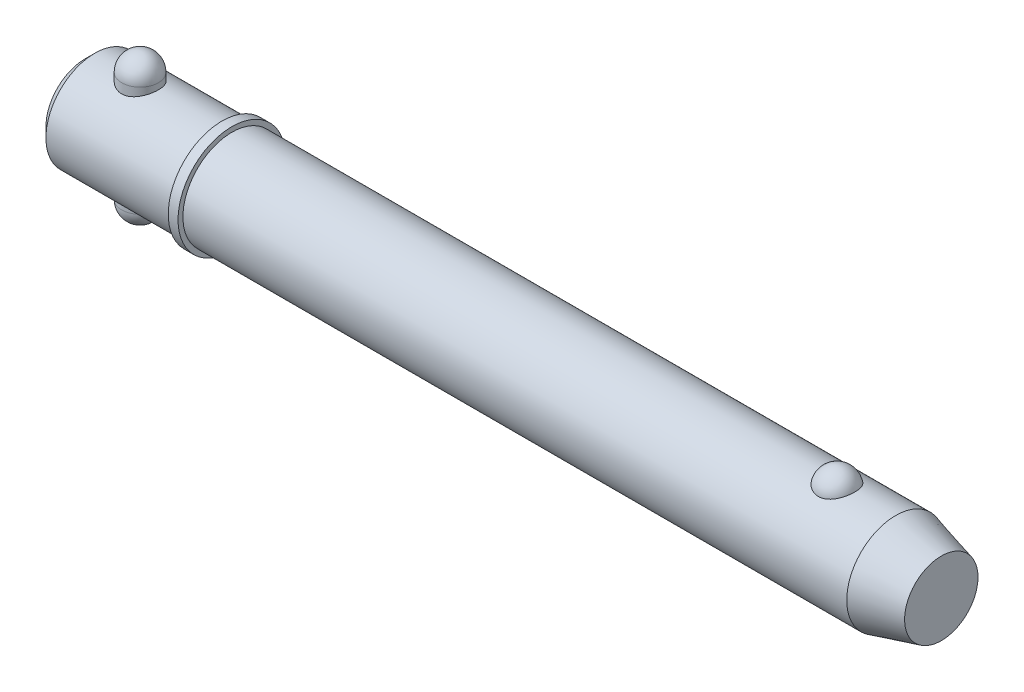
ISO-10303-21;
HEADER;
FILE_DESCRIPTION(('STEP AP214'),'2;1');
FILE_NAME('part.step','',(''),(''),'','','');
FILE_SCHEMA(('AUTOMOTIVE_DESIGN { 1 0 10303 214 1 1 1 1 }'));
ENDSEC;
DATA;
#1=APPLICATION_CONTEXT('core data for automotive mechanical design processes');
#2=APPLICATION_PROTOCOL_DEFINITION('international standard','automotive_design',2000,#1);
#3=PRODUCT_CONTEXT('',#1,'mechanical');
#4=PRODUCT('Part','Part','',(#3));
#5=PRODUCT_RELATED_PRODUCT_CATEGORY('part','',(#4));
#6=PRODUCT_DEFINITION_FORMATION('','',#4);
#7=PRODUCT_DEFINITION_CONTEXT('part definition',#1,'design');
#8=PRODUCT_DEFINITION('design','',#6,#7);
#9=PRODUCT_DEFINITION_SHAPE('','',#8);
#10=(LENGTH_UNIT() NAMED_UNIT(*) SI_UNIT(.MILLI.,.METRE.));
#11=(NAMED_UNIT(*) PLANE_ANGLE_UNIT() SI_UNIT($,.RADIAN.));
#12=(NAMED_UNIT(*) SI_UNIT($,.STERADIAN.) SOLID_ANGLE_UNIT());
#13=UNCERTAINTY_MEASURE_WITH_UNIT(LENGTH_MEASURE(1.E-05),#10,'distance_accuracy_value','');
#14=(GEOMETRIC_REPRESENTATION_CONTEXT(3) GLOBAL_UNCERTAINTY_ASSIGNED_CONTEXT((#13)) GLOBAL_UNIT_ASSIGNED_CONTEXT((#10,
#11,#12)) REPRESENTATION_CONTEXT('',''));
#15=CARTESIAN_POINT('',(0.,0.,0.));
#16=DIRECTION('',(0.,0.,1.));
#17=DIRECTION('',(1.,0.,0.));
#18=AXIS2_PLACEMENT_3D('',#15,#16,#17);
#19=CARTESIAN_POINT('',(14.28,19.05,0.));
#20=DIRECTION('',(0.,-1.,0.));
#21=DIRECTION('',(0.,0.,-1.));
#22=AXIS2_PLACEMENT_3D('',#19,#20,#21);
#23=CYLINDRICAL_SURFACE('',#22,4.76);
#24=CARTESIAN_POINT('',(14.28,-14.29,0.));
#25=DIRECTION('',(0.,-1.,0.));
#26=DIRECTION('',(0.,0.,-1.));
#27=AXIS2_PLACEMENT_3D('',#24,#25,#26);
#28=CIRCLE('',#27,4.76);
#29=CARTESIAN_POINT('',(14.28,-14.29,-4.76));
#30=VERTEX_POINT('',#29);
#31=EDGE_CURVE('P0_E10',#30,#30,#28,.F.);
#32=CARTESIAN_POINT('',(14.28,14.29,0.));
#33=DIRECTION('',(0.,-1.,0.));
#34=DIRECTION('',(0.,0.,-1.));
#35=AXIS2_PLACEMENT_3D('',#32,#33,#34);
#36=CIRCLE('',#35,4.76);
#37=CARTESIAN_POINT('',(14.28,14.29,-4.76));
#38=VERTEX_POINT('',#37);
#39=EDGE_CURVE('P0_E21',#38,#38,#36,.T.);
#40=CARTESIAN_POINT('',(14.28,-14.29,-4.76));
#41=CARTESIAN_POINT('',(14.28,-13.9922916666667,-4.76));
#42=CARTESIAN_POINT('',(14.28,-13.6945833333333,-4.76));
#43=CARTESIAN_POINT('',(14.28,-13.0991666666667,-4.76));
#44=CARTESIAN_POINT('',(14.28,-12.8014583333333,-4.76));
#45=CARTESIAN_POINT('',(14.28,-12.2060416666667,-4.76));
#46=CARTESIAN_POINT('',(14.28,-11.9083333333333,-4.76));
#47=CARTESIAN_POINT('',(14.28,-11.3129166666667,-4.76));
#48=CARTESIAN_POINT('',(14.28,-11.0152083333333,-4.76));
#49=CARTESIAN_POINT('',(14.28,-10.4197916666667,-4.76));
#50=CARTESIAN_POINT('',(14.28,-10.1220833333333,-4.76));
#51=CARTESIAN_POINT('',(14.28,-9.52666666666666,-4.76));
#52=CARTESIAN_POINT('',(14.28,-9.22895833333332,-4.76));
#53=CARTESIAN_POINT('',(14.28,-8.63354166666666,-4.76));
#54=CARTESIAN_POINT('',(14.28,-8.33583333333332,-4.76));
#55=CARTESIAN_POINT('',(14.28,-7.74041666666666,-4.76));
#56=CARTESIAN_POINT('',(14.28,-7.44270833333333,-4.76));
#57=CARTESIAN_POINT('',(14.28,-6.84729166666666,-4.76));
#58=CARTESIAN_POINT('',(14.28,-6.54958333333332,-4.76));
#59=CARTESIAN_POINT('',(14.28,-5.95416666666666,-4.76));
#60=CARTESIAN_POINT('',(14.28,-5.65645833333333,-4.76));
#61=CARTESIAN_POINT('',(14.28,-5.06104166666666,-4.76));
#62=CARTESIAN_POINT('',(14.28,-4.76333333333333,-4.76));
#63=CARTESIAN_POINT('',(14.28,-4.16791666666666,-4.76));
#64=CARTESIAN_POINT('',(14.28,-3.87020833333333,-4.76));
#65=CARTESIAN_POINT('',(14.28,-3.27479166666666,-4.76));
#66=CARTESIAN_POINT('',(14.28,-2.97708333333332,-4.76));
#67=CARTESIAN_POINT('',(14.28,-2.38166666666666,-4.76));
#68=CARTESIAN_POINT('',(14.28,-2.08395833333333,-4.76));
#69=CARTESIAN_POINT('',(14.28,-1.48854166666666,-4.76));
#70=CARTESIAN_POINT('',(14.28,-1.19083333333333,-4.76));
#71=CARTESIAN_POINT('',(14.28,-0.595416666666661,-4.76));
#72=CARTESIAN_POINT('',(14.28,-0.297708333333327,-4.76));
#73=CARTESIAN_POINT('',(14.28,0.297708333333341,-4.76));
#74=CARTESIAN_POINT('',(14.28,0.595416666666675,-4.76));
#75=CARTESIAN_POINT('',(14.28,1.19083333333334,-4.76));
#76=CARTESIAN_POINT('',(14.28,1.48854166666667,-4.76));
#77=CARTESIAN_POINT('',(14.28,2.08395833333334,-4.76));
#78=CARTESIAN_POINT('',(14.28,2.38166666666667,-4.76));
#79=CARTESIAN_POINT('',(14.28,2.97708333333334,-4.76));
#80=CARTESIAN_POINT('',(14.28,3.27479166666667,-4.76));
#81=CARTESIAN_POINT('',(14.28,3.87020833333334,-4.76));
#82=CARTESIAN_POINT('',(14.28,4.16791666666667,-4.76));
#83=CARTESIAN_POINT('',(14.28,4.76333333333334,-4.76));
#84=CARTESIAN_POINT('',(14.28,5.06104166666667,-4.76));
#85=CARTESIAN_POINT('',(14.28,5.65645833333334,-4.76));
#86=CARTESIAN_POINT('',(14.28,5.95416666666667,-4.76));
#87=CARTESIAN_POINT('',(14.28,6.54958333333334,-4.76));
#88=CARTESIAN_POINT('',(14.28,6.84729166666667,-4.76));
#89=CARTESIAN_POINT('',(14.28,7.44270833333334,-4.76));
#90=CARTESIAN_POINT('',(14.28,7.74041666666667,-4.76));
#91=CARTESIAN_POINT('',(14.28,8.33583333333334,-4.76));
#92=CARTESIAN_POINT('',(14.28,8.63354166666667,-4.76));
#93=CARTESIAN_POINT('',(14.28,9.22895833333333,-4.76));
#94=CARTESIAN_POINT('',(14.28,9.52666666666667,-4.76));
#95=CARTESIAN_POINT('',(14.28,10.1220833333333,-4.76));
#96=CARTESIAN_POINT('',(14.28,10.4197916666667,-4.76));
#97=CARTESIAN_POINT('',(14.28,11.0152083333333,-4.76));
#98=CARTESIAN_POINT('',(14.28,11.3129166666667,-4.76));
#99=CARTESIAN_POINT('',(14.28,11.9083333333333,-4.76));
#100=CARTESIAN_POINT('',(14.28,12.2060416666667,-4.76));
#101=CARTESIAN_POINT('',(14.28,12.8014583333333,-4.76));
#102=CARTESIAN_POINT('',(14.28,13.0991666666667,-4.76));
#103=CARTESIAN_POINT('',(14.28,13.6945833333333,-4.76));
#104=CARTESIAN_POINT('',(14.28,13.9922916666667,-4.76));
#105=CARTESIAN_POINT('',(14.28,14.29,-4.76));
#106=B_SPLINE_CURVE_WITH_KNOTS('',3,(#40,#41,#42,#43,#44,#45,#46,#47,#48,#49,#50,#51,#52,#53,
#54,#55,#56,#57,#58,#59,#60,#61,#62,#63,#64,#65,#66,#67,#68,#69,#70,#71,#72,#73,#74,#75,#76,#77,
#78,#79,#80,#81,#82,#83,#84,#85,#86,#87,#88,#89,#90,#91,#92,#93,#94,#95,#96,#97,#98,#99,#100,
#101,#102,#103,#104,#105),.UNSPECIFIED.,.F.,.F.,(4,2,2,2,2,2,2,2,2,2,2,2,2,2,2,2,2,2,2,2,2,2,2,
2,2,2,2,2,2,2,2,2,4),(0.,0.893125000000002,1.78625,2.67937499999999,3.5725,4.465625,5.35875,
6.25187499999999,7.145,8.038125,8.93125,9.82437499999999,10.7175,11.610625,12.50375,13.396875,
14.29,15.183125,16.07625,16.969375,17.8625,18.755625,19.64875,20.541875,21.435,22.328125,
23.22125,24.114375,25.0075,25.900625,26.79375,27.686875,28.58),.UNSPECIFIED.);
#107=EDGE_CURVE('P0_BSEAM14',#30,#38,#106,.T.);
#108=ORIENTED_EDGE('',*,*,#31,.T.);
#109=ORIENTED_EDGE('',*,*,#39,.T.);
#110=ORIENTED_EDGE('',*,*,#107,.T.);
#111=ORIENTED_EDGE('',*,*,#107,.F.);
#112=EDGE_LOOP('',(#108,#110,#109,#111));
#113=FACE_BOUND('',#112,.T.);
#114=ADVANCED_FACE('P0_F14',(#113),#23,.T.);
#115=CARTESIAN_POINT('',(14.28,-14.29,0.));
#116=DIRECTION('',(0.,0.,1.));
#117=DIRECTION('',(1.,0.,0.));
#118=AXIS2_PLACEMENT_3D('',#115,#116,#117);
#119=SPHERICAL_SURFACE('',#118,4.76);
#120=CARTESIAN_POINT('',(14.28,-14.29,0.));
#121=DIRECTION('',(0.,-1.,0.));
#122=DIRECTION('',(0.,0.,-1.));
#123=AXIS2_PLACEMENT_3D('',#120,#121,#122);
#124=SPHERICAL_SURFACE('',#123,4.76);
#125=ORIENTED_EDGE('',*,*,#31,.F.);
#126=EDGE_LOOP('',(#125));
#127=FACE_BOUND('',#126,.T.);
#128=ADVANCED_FACE('P0_F29',(#127),#124,.T.);
#129=CARTESIAN_POINT('',(14.28,14.29,0.));
#130=DIRECTION('',(0.,0.,1.));
#131=DIRECTION('',(1.,0.,0.));
#132=AXIS2_PLACEMENT_3D('',#129,#130,#131);
#133=SPHERICAL_SURFACE('',#132,4.76);
#134=CARTESIAN_POINT('',(14.28,14.29,0.));
#135=DIRECTION('',(0.,-1.,0.));
#136=DIRECTION('',(0.,0.,-1.));
#137=AXIS2_PLACEMENT_3D('',#134,#135,#136);
#138=SPHERICAL_SURFACE('',#137,4.76);
#139=ORIENTED_EDGE('',*,*,#39,.F.);
#140=EDGE_LOOP('',(#139));
#141=FACE_BOUND('',#140,.T.);
#142=ADVANCED_FACE('P0_F16',(#141),#138,.T.);
#143=CLOSED_SHELL('',(#114,#128,#142));
#144=MANIFOLD_SOLID_BREP('P0_B1',#143);
#145=CARTESIAN_POINT('',(0.,0.,0.));
#146=DIRECTION('',(1.,0.,0.));
#147=DIRECTION('',(0.,0.,-1.));
#148=AXIS2_PLACEMENT_3D('',#145,#146,#147);
#149=CYLINDRICAL_SURFACE('',#148,12.7);
#150=CARTESIAN_POINT('',(210.400738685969,0.,0.));
#151=DIRECTION('',(1.,0.,0.));
#152=DIRECTION('',(0.,0.,-1.));
#153=AXIS2_PLACEMENT_3D('',#150,#151,#152);
#154=CIRCLE('',#153,12.7);
#155=CARTESIAN_POINT('',(210.400738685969,0.,-12.7));
#156=VERTEX_POINT('',#155);
#157=EDGE_CURVE('P1_E81',#156,#156,#154,.T.);
#158=ORIENTED_EDGE('',*,*,#157,.F.);
#159=EDGE_LOOP('',(#158));
#160=FACE_BOUND('',#159,.T.);
#161=CARTESIAN_POINT('',(38.1,0.,0.));
#162=DIRECTION('',(1.,0.,0.));
#163=DIRECTION('',(0.,0.,-1.));
#164=AXIS2_PLACEMENT_3D('',#161,#162,#163);
#165=CIRCLE('',#164,12.7);
#166=CARTESIAN_POINT('',(38.1,0.,-12.7));
#167=VERTEX_POINT('',#166);
#168=EDGE_CURVE('P1_E85',#167,#167,#165,.T.);
#169=ORIENTED_EDGE('',*,*,#168,.T.);
#170=EDGE_LOOP('',(#169));
#171=FACE_BOUND('',#170,.T.);
#172=CARTESIAN_POINT('',(195.160042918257,11.7500437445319,4.81938502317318));
#173=CARTESIAN_POINT('',(195.035088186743,11.7500430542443,4.81938571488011));
#174=CARTESIAN_POINT('',(194.910144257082,11.7520975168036,4.81438658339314));
#175=CARTESIAN_POINT('',(194.661142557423,11.760253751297,4.79442904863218));
#176=CARTESIAN_POINT('',(194.537085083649,11.7663568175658,4.77946746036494));
#177=CARTESIAN_POINT('',(194.290901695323,11.7824262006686,4.7397141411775));
#178=CARTESIAN_POINT('',(194.168774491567,11.7923898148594,4.71492928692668));
#179=CARTESIAN_POINT('',(193.927187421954,11.8158938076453,4.65571340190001));
#180=CARTESIAN_POINT('',(193.80772859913,11.8294355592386,4.6212786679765));
#181=CARTESIAN_POINT('',(193.572557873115,11.8596812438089,4.54309502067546));
#182=CARTESIAN_POINT('',(193.456839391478,11.8763792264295,4.49936361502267));
#183=CARTESIAN_POINT('',(193.229653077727,11.9124878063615,4.40287235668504));
#184=CARTESIAN_POINT('',(193.118186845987,11.9318994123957,4.35010914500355));
#185=CARTESIAN_POINT('',(192.791278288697,11.9934256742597,4.17881316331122));
#186=CARTESIAN_POINT('',(192.583127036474,12.038858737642,4.04720756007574));
#187=CARTESIAN_POINT('',(192.185850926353,12.1352173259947,3.748564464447));
#188=CARTESIAN_POINT('',(191.997443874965,12.1862630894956,3.58061821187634));
#189=CARTESIAN_POINT('',(191.650521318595,12.2875163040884,3.21600758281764));
#190=CARTESIAN_POINT('',(191.492011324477,12.3377235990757,3.0193379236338));
#191=CARTESIAN_POINT('',(191.20168878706,12.4344923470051,2.592916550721));
#192=CARTESIAN_POINT('',(191.071376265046,12.4807925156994,2.36208286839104));
#193=CARTESIAN_POINT('',(190.849407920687,12.5623454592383,1.88070399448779));
#194=CARTESIAN_POINT('',(190.757755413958,12.5975972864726,1.63015711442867));
#195=CARTESIAN_POINT('',(190.614046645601,12.6538414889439,1.1129886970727));
#196=CARTESIAN_POINT('',(190.562499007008,12.6746503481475,0.846205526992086));
#197=CARTESIAN_POINT('',(190.501977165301,12.699153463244,0.307085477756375));
#198=CARTESIAN_POINT('',(190.493001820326,12.7028481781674,0.034748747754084));
#199=CARTESIAN_POINT('',(190.517731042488,12.6927785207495,-0.506073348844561));
#200=CARTESIAN_POINT('',(190.551189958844,12.6791146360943,-0.774571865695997));
#201=CARTESIAN_POINT('',(190.659687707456,12.635882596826,-1.30170246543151));
#202=CARTESIAN_POINT('',(190.73472729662,12.606314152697,-1.56033436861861));
#203=CARTESIAN_POINT('',(190.925000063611,12.5342328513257,-2.0608389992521));
#204=CARTESIAN_POINT('',(191.040287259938,12.4917026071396,-2.30268867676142));
#205=CARTESIAN_POINT('',(191.308704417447,12.3981123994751,-2.76259600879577));
#206=CARTESIAN_POINT('',(191.461837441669,12.3470517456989,-2.98065173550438));
#207=CARTESIAN_POINT('',(191.803507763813,12.2416045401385,-3.38786328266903));
#208=CARTESIAN_POINT('',(191.992201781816,12.1872040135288,-3.57688418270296));
#209=CARTESIAN_POINT('',(192.400239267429,12.0814086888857,-3.91941073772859));
#210=CARTESIAN_POINT('',(192.619580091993,12.0300136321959,-4.07291945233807));
#211=CARTESIAN_POINT('',(193.078375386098,11.9373542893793,-4.33691289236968));
#212=CARTESIAN_POINT('',(193.317304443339,11.8958982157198,-4.44824125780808));
#213=CARTESIAN_POINT('',(193.81243761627,11.8268116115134,-4.62881985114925));
#214=CARTESIAN_POINT('',(194.068635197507,11.7991758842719,-4.69808589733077));
#215=CARTESIAN_POINT('',(194.577164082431,11.7622209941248,-4.78983181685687));
#216=CARTESIAN_POINT('',(194.829041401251,11.7520502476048,-4.81449025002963));
#217=CARTESIAN_POINT('',(195.333573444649,11.7485796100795,-4.82295735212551));
#218=CARTESIAN_POINT('',(195.586228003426,11.7552763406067,-4.80677420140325));
#219=CARTESIAN_POINT('',(196.076834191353,11.7842584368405,-4.73525430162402));
#220=CARTESIAN_POINT('',(196.314998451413,11.8060486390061,-4.68116061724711));
#221=CARTESIAN_POINT('',(196.778489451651,11.8622750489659,-4.53678133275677));
#222=CARTESIAN_POINT('',(197.003815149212,11.8967122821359,-4.44649279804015));
#223=CARTESIAN_POINT('',(197.440801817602,11.9754603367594,-4.2298761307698));
#224=CARTESIAN_POINT('',(197.652057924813,12.0199699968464,-4.10280539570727));
#225=CARTESIAN_POINT('',(198.050601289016,12.1138028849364,-3.81685409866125));
#226=CARTESIAN_POINT('',(198.237883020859,12.163127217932,-3.65796622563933));
#227=CARTESIAN_POINT('',(198.593350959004,12.2642343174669,-3.30364864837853));
#228=CARTESIAN_POINT('',(198.760111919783,12.3160165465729,-3.10678783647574));
#229=CARTESIAN_POINT('',(199.059579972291,12.4142566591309,-2.68748409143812));
#230=CARTESIAN_POINT('',(199.192280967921,12.4607135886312,-2.4650365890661));
#231=CARTESIAN_POINT('',(199.424691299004,12.5450236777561,-1.9928951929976));
#232=CARTESIAN_POINT('',(199.523215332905,12.5825557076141,-1.74255918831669));
#233=CARTESIAN_POINT('',(199.679227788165,12.6431720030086,-1.22773734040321));
#234=CARTESIAN_POINT('',(199.736715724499,12.6662560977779,-0.963251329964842));
#235=CARTESIAN_POINT('',(199.809544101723,12.6956486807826,-0.4273550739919));
#236=CARTESIAN_POINT('',(199.824837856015,12.7019385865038,-0.155937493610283));
#237=CARTESIAN_POINT('',(199.812779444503,12.6970201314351,0.385928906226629));
#238=CARTESIAN_POINT('',(199.78542805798,12.6858120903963,0.656377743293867));
#239=CARTESIAN_POINT('',(199.713060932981,12.6568455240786,1.05454017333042));
#240=CARTESIAN_POINT('',(199.683796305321,12.6451962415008,1.18577850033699));
#241=CARTESIAN_POINT('',(199.615022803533,12.6181819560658,1.4451380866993));
#242=CARTESIAN_POINT('',(199.575517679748,12.6028183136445,1.57326046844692));
#243=CARTESIAN_POINT('',(199.486439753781,12.5687547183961,1.82554978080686));
#244=CARTESIAN_POINT('',(199.436862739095,12.5500533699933,1.9497150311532));
#245=CARTESIAN_POINT('',(199.32792115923,12.5098093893,2.19314370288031));
#246=CARTESIAN_POINT('',(199.268560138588,12.4882677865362,2.31240887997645));
#247=CARTESIAN_POINT('',(199.13997128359,12.4427679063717,2.5459303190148));
#248=CARTESIAN_POINT('',(199.070688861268,12.4187964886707,2.66015396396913));
#249=CARTESIAN_POINT('',(198.922903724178,12.3691892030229,2.88202659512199));
#250=CARTESIAN_POINT('',(198.844404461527,12.3435539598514,2.98967802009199));
#251=CARTESIAN_POINT('',(198.678550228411,12.2912955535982,3.1977438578));
#252=CARTESIAN_POINT('',(198.591191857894,12.2646720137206,3.298155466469));
#253=CARTESIAN_POINT('',(198.408161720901,12.2111945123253,3.49095035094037));
#254=CARTESIAN_POINT('',(198.312493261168,12.1843406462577,3.58333679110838));
#255=CARTESIAN_POINT('',(198.113627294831,12.1312249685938,3.75922876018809));
#256=CARTESIAN_POINT('',(198.010450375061,12.104961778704,3.84275713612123));
#257=CARTESIAN_POINT('',(197.79701336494,12.0537284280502,4.00056406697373));
#258=CARTESIAN_POINT('',(197.686756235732,12.028757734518,4.07484645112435));
#259=CARTESIAN_POINT('',(197.459755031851,11.9808306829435,4.21367959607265));
#260=CARTESIAN_POINT('',(197.343006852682,11.9578756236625,4.27822410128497));
#261=CARTESIAN_POINT('',(197.10394258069,11.9147184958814,4.39698483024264));
#262=CARTESIAN_POINT('',(196.981628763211,11.894515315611,4.45120522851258));
#263=CARTESIAN_POINT('',(196.722952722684,11.8561129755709,4.55255353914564));
#264=CARTESIAN_POINT('',(196.586223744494,11.8381764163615,4.59884858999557));
#265=CARTESIAN_POINT('',(196.308608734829,11.8069093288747,4.67853897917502));
#266=CARTESIAN_POINT('',(196.167724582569,11.7935767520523,4.71194005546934));
#267=CARTESIAN_POINT('',(195.88309446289,11.7720277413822,4.76552188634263));
#268=CARTESIAN_POINT('',(195.739348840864,11.7638106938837,4.78570422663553));
#269=CARTESIAN_POINT('',(195.450411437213,11.7528195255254,4.81263433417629));
#270=CARTESIAN_POINT('',(195.305219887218,11.7500445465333,4.81938421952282));
#271=CARTESIAN_POINT('',(195.160042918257,11.7500437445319,4.81938502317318));
#272=B_SPLINE_CURVE_WITH_KNOTS('',3,(#172,#173,#174,#175,#176,#177,#178,#179,#180,#181,#182,
#183,#184,#185,#186,#187,#188,#189,#190,#191,#192,#193,#194,#195,#196,#197,#198,#199,#200,#201,
#202,#203,#204,#205,#206,#207,#208,#209,#210,#211,#212,#213,#214,#215,#216,#217,#218,#219,#220,
#221,#222,#223,#224,#225,#226,#227,#228,#229,#230,#231,#232,#233,#234,#235,#236,#237,#238,#239,
#240,#241,#242,#243,#244,#245,#246,#247,#248,#249,#250,#251,#252,#253,#254,#255,#256,#257,#258,
#259,#260,#261,#262,#263,#264,#265,#266,#267,#268,#269,#270,#271),.UNSPECIFIED.,.T.,.F.,(4,2,2,
2,2,2,2,2,2,2,2,2,2,2,2,2,2,2,2,2,2,2,2,2,2,2,2,2,2,2,2,2,2,2,2,2,2,2,2,2,2,2,2,2,2,2,2,2,2,4),
(0.,0.374729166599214,0.749578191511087,1.12416526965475,1.49889629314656,1.87292776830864,
2.24709865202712,2.99481328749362,3.76399449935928,4.53331735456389,5.3368391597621,
6.14042986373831,6.95405296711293,7.76765424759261,8.57656703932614,9.38549455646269,
10.1955119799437,11.0055949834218,11.8193353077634,12.6330054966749,13.4294141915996,
14.2255231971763,14.9815786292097,15.7374826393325,16.4696948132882,17.2019663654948,
17.9501979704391,18.6986017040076,19.4844704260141,20.2704797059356,21.0815215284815,
21.8925729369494,22.7045213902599,23.5164550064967,23.9209608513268,24.3253187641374,
24.7298461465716,25.1342272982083,25.54092555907,25.947471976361,26.3541750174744,
26.7607169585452,27.1661834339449,27.5714814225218,27.9770386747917,28.3824315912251,
28.818120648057,29.2536155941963,29.6890582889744,30.1244323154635),.UNSPECIFIED.);
#273=CARTESIAN_POINT('',(195.160042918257,11.7500437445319,4.81938502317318));
#274=VERTEX_POINT('',#273);
#275=EDGE_CURVE('P1_E35',#274,#274,#272,.T.);
#276=ORIENTED_EDGE('',*,*,#275,.T.);
#277=EDGE_LOOP('',(#276));
#278=FACE_BOUND('',#277,.T.);
#279=ADVANCED_FACE('P1_F13',(#160,#171,#278),#149,.T.);
#280=CARTESIAN_POINT('',(0.,0.,0.));
#281=DIRECTION('',(-1.,0.,0.));
#282=DIRECTION('',(0.,0.,1.));
#283=AXIS2_PLACEMENT_3D('',#280,#281,#282);
#284=PLANE('',#283);
#285=CARTESIAN_POINT('',(0.,0.,0.));
#286=DIRECTION('',(1.,0.,0.));
#287=DIRECTION('',(0.,0.,-1.));
#288=AXIS2_PLACEMENT_3D('',#285,#286,#287);
#289=CIRCLE('',#288,10.16);
#290=CARTESIAN_POINT('',(0.,0.,-10.16));
#291=VERTEX_POINT('',#290);
#292=EDGE_CURVE('P1_E9',#291,#291,#289,.T.);
#293=ORIENTED_EDGE('',*,*,#292,.F.);
#294=EDGE_LOOP('',(#293));
#295=FACE_BOUND('',#294,.T.);
#296=ADVANCED_FACE('P1_F15',(#295),#284,.T.);
#297=CARTESIAN_POINT('',(2.53999999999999,0.,0.));
#298=DIRECTION('',(1.,0.,0.));
#299=DIRECTION('',(0.,0.,-1.));
#300=AXIS2_PLACEMENT_3D('',#297,#298,#299);
#301=CONICAL_SURFACE('',#300,12.7,0.78539816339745);
#302=ORIENTED_EDGE('',*,*,#292,.T.);
#303=EDGE_LOOP('',(#302));
#304=FACE_BOUND('',#303,.T.);
#305=CARTESIAN_POINT('',(2.53999999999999,0.,0.));
#306=DIRECTION('',(1.,0.,0.));
#307=DIRECTION('',(0.,0.,-1.));
#308=AXIS2_PLACEMENT_3D('',#305,#306,#307);
#309=CIRCLE('',#308,12.7);
#310=CARTESIAN_POINT('',(2.53999999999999,0.,-12.7));
#311=VERTEX_POINT('',#310);
#312=EDGE_CURVE('P1_E26',#311,#311,#309,.T.);
#313=ORIENTED_EDGE('',*,*,#312,.F.);
#314=EDGE_LOOP('',(#313));
#315=FACE_BOUND('',#314,.T.);
#316=ADVANCED_FACE('P1_F77',(#304,#315),#301,.T.);
#317=CARTESIAN_POINT('',(0.,0.,0.));
#318=DIRECTION('',(1.,0.,0.));
#319=DIRECTION('',(0.,0.,-1.));
#320=AXIS2_PLACEMENT_3D('',#317,#318,#319);
#321=CYLINDRICAL_SURFACE('',#320,12.7);
#322=CARTESIAN_POINT('',(14.28,-11.7742260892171,4.76));
#323=CARTESIAN_POINT('',(14.1514948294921,-11.7742255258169,4.76000061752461));
#324=CARTESIAN_POINT('',(14.0229980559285,-11.7763355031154,4.75479194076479));
#325=CARTESIAN_POINT('',(13.7669369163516,-11.7847043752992,4.73401198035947));
#326=CARTESIAN_POINT('',(13.6393728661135,-11.7909646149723,4.71843733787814));
#327=CARTESIAN_POINT('',(13.386226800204,-11.8074248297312,4.67709434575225));
#328=CARTESIAN_POINT('',(13.2606439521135,-11.8176231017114,4.65133040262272));
#329=CARTESIAN_POINT('',(13.0122434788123,-11.8416347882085,4.58985545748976));
#330=CARTESIAN_POINT('',(12.8894269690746,-11.8554496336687,4.55414051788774));
#331=CARTESIAN_POINT('',(12.6477622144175,-11.8862222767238,4.47320764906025));
#332=CARTESIAN_POINT('',(12.5289037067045,-11.9031710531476,4.4280169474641));
#333=CARTESIAN_POINT('',(12.2955059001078,-11.939736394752,4.32845291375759));
#334=CARTESIAN_POINT('',(12.1809682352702,-11.9593539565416,4.2740761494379));
#335=CARTESIAN_POINT('',(11.8448901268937,-12.0213893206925,4.09777237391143));
#336=CARTESIAN_POINT('',(11.6307077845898,-12.0670135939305,3.9626122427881));
#337=CARTESIAN_POINT('',(11.2179129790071,-12.1641514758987,3.65386230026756));
#338=CARTESIAN_POINT('',(11.0204399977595,-12.2158379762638,3.47881300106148));
#339=CARTESIAN_POINT('',(10.6568212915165,-12.3178468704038,3.09829182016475));
#340=CARTESIAN_POINT('',(10.4906822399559,-12.3681689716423,2.89281347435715));
#341=CARTESIAN_POINT('',(10.1890299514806,-12.4638367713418,2.44867909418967));
#342=CARTESIAN_POINT('',(10.054749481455,-12.5089552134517,2.20913281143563));
#343=CARTESIAN_POINT('',(9.82886079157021,-12.5870472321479,1.70885919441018));
#344=CARTESIAN_POINT('',(9.73723778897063,-12.620025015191,1.44813923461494));
#345=CARTESIAN_POINT('',(9.60324488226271,-12.6688874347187,0.9248423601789));
#346=CARTESIAN_POINT('',(9.55892269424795,-12.6854474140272,0.662829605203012));
#347=CARTESIAN_POINT('',(9.5145335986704,-12.7020320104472,0.134596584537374));
#348=CARTESIAN_POINT('',(9.5144523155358,-12.7020619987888,-0.131622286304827));
#349=CARTESIAN_POINT('',(9.55741019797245,-12.6860129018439,-0.646717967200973));
#350=CARTESIAN_POINT('',(9.59831845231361,-12.6707298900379,-0.895801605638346));
#351=CARTESIAN_POINT('',(9.71850987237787,-12.6268158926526,-1.38327219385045));
#352=CARTESIAN_POINT('',(9.79779575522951,-12.5981839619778,-1.62165838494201));
#353=CARTESIAN_POINT('',(9.99348296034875,-12.5298894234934,-2.08508424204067));
#354=CARTESIAN_POINT('',(10.110407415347,-12.4900724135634,-2.30987931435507));
#355=CARTESIAN_POINT('',(10.3775896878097,-12.4034373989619,-2.7372158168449));
#356=CARTESIAN_POINT('',(10.5278582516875,-12.3566171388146,-2.93975004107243));
#357=CARTESIAN_POINT('',(10.8677318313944,-12.257571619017,-3.32936830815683));
#358=CARTESIAN_POINT('',(11.0591227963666,-12.2051903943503,-3.51485714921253));
#359=CARTESIAN_POINT('',(11.4706087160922,-12.1031155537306,-3.85170663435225));
#360=CARTESIAN_POINT('',(11.6907108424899,-12.0534226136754,-4.00305872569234));
#361=CARTESIAN_POINT('',(12.1596597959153,-11.9613684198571,-4.27038218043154));
#362=CARTESIAN_POINT('',(12.4090353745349,-11.9191939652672,-4.38549550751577));
#363=CARTESIAN_POINT('',(12.9256290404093,-11.8491124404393,-4.57149117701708));
#364=CARTESIAN_POINT('',(13.1928371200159,-11.8211974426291,-4.64239810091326));
#365=CARTESIAN_POINT('',(13.7217488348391,-11.7846654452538,-4.73434137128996));
#366=CARTESIAN_POINT('',(13.9829438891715,-11.7750694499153,-4.75791141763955));
#367=CARTESIAN_POINT('',(14.5056760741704,-11.7734909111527,-4.76182097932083));
#368=CARTESIAN_POINT('',(14.7672131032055,-11.7815039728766,-4.74217128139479));
#369=CARTESIAN_POINT('',(15.2702140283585,-11.8132466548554,-4.66249544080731));
#370=CARTESIAN_POINT('',(15.5120417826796,-11.8362133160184,-4.60442726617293));
#371=CARTESIAN_POINT('',(15.9824097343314,-11.8943704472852,-4.45202868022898));
#372=CARTESIAN_POINT('',(16.2109472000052,-11.9295634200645,-4.35769084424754));
#373=CARTESIAN_POINT('',(16.6577741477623,-12.0098310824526,-4.13144368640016));
#374=CARTESIAN_POINT('',(16.8753590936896,-12.055226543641,-3.99825937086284));
#375=CARTESIAN_POINT('',(17.2859732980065,-12.150238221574,-3.69949845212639));
#376=CARTESIAN_POINT('',(17.4789935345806,-12.19985597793,-3.5339100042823));
#377=CARTESIAN_POINT('',(17.8477707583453,-12.3015434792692,-3.1624728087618));
#378=CARTESIAN_POINT('',(18.0216609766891,-12.3535695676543,-2.95473880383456));
#379=CARTESIAN_POINT('',(18.254545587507,-12.426745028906,-2.62277433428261));
#380=CARTESIAN_POINT('',(18.3275489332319,-12.4503382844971,-2.50865480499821));
#381=CARTESIAN_POINT('',(18.463723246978,-12.4952713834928,-2.27428971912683));
#382=CARTESIAN_POINT('',(18.5268984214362,-12.5166121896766,-2.15404681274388));
#383=CARTESIAN_POINT('',(18.6427140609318,-12.5563817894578,-1.90858448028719));
#384=CARTESIAN_POINT('',(18.6953855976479,-12.5748191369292,-1.78338108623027));
#385=CARTESIAN_POINT('',(18.7899337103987,-12.6083284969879,-1.52857834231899));
#386=CARTESIAN_POINT('',(18.8318147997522,-12.6234019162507,-1.39898085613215));
#387=CARTESIAN_POINT('',(18.9043819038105,-12.6497495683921,-1.13633254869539));
#388=CARTESIAN_POINT('',(18.9350698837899,-12.6610244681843,-1.00328233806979));
#389=CARTESIAN_POINT('',(18.9849303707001,-12.6794412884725,-0.734761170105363));
#390=CARTESIAN_POINT('',(19.0041035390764,-12.6865834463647,-0.59929035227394));
#391=CARTESIAN_POINT('',(19.0299427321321,-12.6962286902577,-0.335006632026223));
#392=CARTESIAN_POINT('',(19.0372742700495,-12.698978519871,-0.206267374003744));
#393=CARTESIAN_POINT('',(19.0414668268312,-12.7005496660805,0.0514515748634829));
#394=CARTESIAN_POINT('',(19.038324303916,-12.69936965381,0.180431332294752));
#395=CARTESIAN_POINT('',(19.0215965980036,-12.6931114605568,0.437551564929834));
#396=CARTESIAN_POINT('',(19.0080165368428,-12.6880351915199,0.565692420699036));
#397=CARTESIAN_POINT('',(18.9705519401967,-12.6741222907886,0.820297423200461));
#398=CARTESIAN_POINT('',(18.9466635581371,-12.665284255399,0.946760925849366));
#399=CARTESIAN_POINT('',(18.8895279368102,-12.6443449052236,1.19395899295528));
#400=CARTESIAN_POINT('',(18.8565273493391,-12.6323299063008,1.3147578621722));
#401=CARTESIAN_POINT('',(18.781239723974,-12.6052503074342,1.55308888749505));
#402=CARTESIAN_POINT('',(18.738949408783,-12.5901846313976,1.67061987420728));
#403=CARTESIAN_POINT('',(18.5986461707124,-12.5409473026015,2.01714406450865));
#404=CARTESIAN_POINT('',(18.4871532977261,-12.502717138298,2.24027279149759));
#405=CARTESIAN_POINT('',(18.2262440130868,-12.4173042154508,2.6742599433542));
#406=CARTESIAN_POINT('',(18.0754310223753,-12.3698127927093,2.88420891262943));
#407=CARTESIAN_POINT('',(17.7421836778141,-12.271667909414,3.27675114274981));
#408=CARTESIAN_POINT('',(17.5597380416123,-12.2210133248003,3.45933459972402));
#409=CARTESIAN_POINT('',(17.2605468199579,-12.1452079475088,3.7138066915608));
#410=CARTESIAN_POINT('',(17.1535518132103,-12.119328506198,3.79719993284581));
#411=CARTESIAN_POINT('',(16.9326449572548,-12.0688597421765,3.95467398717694));
#412=CARTESIAN_POINT('',(16.8187356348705,-12.0442699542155,4.02875817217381));
#413=CARTESIAN_POINT('',(16.5846234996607,-11.9971053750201,4.16711104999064));
#414=CARTESIAN_POINT('',(16.4644172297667,-11.9745317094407,4.23137427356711));
#415=CARTESIAN_POINT('',(16.2185866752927,-11.9321360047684,4.34949041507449));
#416=CARTESIAN_POINT('',(16.09296473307,-11.9123127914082,4.40334777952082));
#417=CARTESIAN_POINT('',(15.8314769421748,-11.875268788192,4.50232278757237));
#418=CARTESIAN_POINT('',(15.6954035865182,-11.8582009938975,4.54695127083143));
#419=CARTESIAN_POINT('',(15.4194002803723,-11.8284328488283,4.62383807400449));
#420=CARTESIAN_POINT('',(15.2794720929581,-11.815730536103,4.6561019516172));
#421=CARTESIAN_POINT('',(14.9969657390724,-11.7951940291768,4.70788444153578));
#422=CARTESIAN_POINT('',(14.8543884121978,-11.7873583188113,4.72740702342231));
#423=CARTESIAN_POINT('',(14.5678704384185,-11.7768749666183,4.75346370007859));
#424=CARTESIAN_POINT('',(14.4239299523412,-11.7742267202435,4.75999930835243));
#425=CARTESIAN_POINT('',(14.28,-11.7742260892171,4.76));
#426=B_SPLINE_CURVE_WITH_KNOTS('',3,(#322,#323,#324,#325,#326,#327,#328,#329,#330,#331,#332,
#333,#334,#335,#336,#337,#338,#339,#340,#341,#342,#343,#344,#345,#346,#347,#348,#349,#350,#351,
#352,#353,#354,#355,#356,#357,#358,#359,#360,#361,#362,#363,#364,#365,#366,#367,#368,#369,#370,
#371,#372,#373,#374,#375,#376,#377,#378,#379,#380,#381,#382,#383,#384,#385,#386,#387,#388,#389,
#390,#391,#392,#393,#394,#395,#396,#397,#398,#399,#400,#401,#402,#403,#404,#405,#406,#407,#408,
#409,#410,#411,#412,#413,#414,#415,#416,#417,#418,#419,#420,#421,#422,#423,#424,#425),
.UNSPECIFIED.,.T.,.F.,(4,2,2,2,2,2,2,2,2,2,2,2,2,2,2,2,2,2,2,2,2,2,2,2,2,2,2,2,2,2,2,2,2,2,2,2,
2,2,2,2,2,2,2,2,2,2,2,2,2,2,2,4),(0.,0.385378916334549,0.770882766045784,1.15622008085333,
1.54171009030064,1.92610725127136,2.31064835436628,3.07917291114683,3.88239385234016,
4.68578566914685,5.51648193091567,6.34689010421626,7.14151420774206,7.93588010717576,
8.69098665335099,9.44614666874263,10.2122918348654,10.9786842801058,11.789876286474,
12.6012713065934,13.4306405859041,14.2595482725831,15.0427613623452,15.8257790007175,
16.5716820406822,17.3177378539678,18.0917395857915,18.8660247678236,19.6893332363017,
20.1014571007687,20.5134040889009,20.9241137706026,21.3346513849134,21.7451168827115,
22.1555587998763,22.542011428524,22.928594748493,23.3149884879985,23.7015265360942,
24.0784835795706,24.4555738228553,25.2091300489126,25.994347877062,26.7798463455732,
27.1937428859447,27.6074890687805,28.0214648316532,28.4352633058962,28.8672794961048,
29.299101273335,29.7307884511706,30.1624253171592),.UNSPECIFIED.);
#427=CARTESIAN_POINT('',(14.28,-11.7742260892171,4.76));
#428=VERTEX_POINT('',#427);
#429=EDGE_CURVE('P1_E17',#428,#428,#426,.T.);
#430=ORIENTED_EDGE('',*,*,#429,.F.);
#431=EDGE_LOOP('',(#430));
#432=FACE_BOUND('',#431,.T.);
#433=CARTESIAN_POINT('',(14.28,11.7742260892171,4.76));
#434=CARTESIAN_POINT('',(14.4085051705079,11.7742255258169,4.76000061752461));
#435=CARTESIAN_POINT('',(14.5370019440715,11.7763355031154,4.75479194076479));
#436=CARTESIAN_POINT('',(14.7930630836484,11.7847043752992,4.73401198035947));
#437=CARTESIAN_POINT('',(14.9206271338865,11.7909646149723,4.71843733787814));
#438=CARTESIAN_POINT('',(15.173773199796,11.8074248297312,4.67709434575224));
#439=CARTESIAN_POINT('',(15.2993560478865,11.8176231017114,4.65133040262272));
#440=CARTESIAN_POINT('',(15.5477565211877,11.8416347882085,4.58985545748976));
#441=CARTESIAN_POINT('',(15.6705730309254,11.8554496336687,4.55414051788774));
#442=CARTESIAN_POINT('',(15.9122377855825,11.8862222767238,4.47320764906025));
#443=CARTESIAN_POINT('',(16.0310962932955,11.9031710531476,4.4280169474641));
#444=CARTESIAN_POINT('',(16.2644940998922,11.939736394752,4.32845291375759));
#445=CARTESIAN_POINT('',(16.3790317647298,11.9593539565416,4.2740761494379));
#446=CARTESIAN_POINT('',(16.7151098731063,12.0213893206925,4.09777237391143));
#447=CARTESIAN_POINT('',(16.9292922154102,12.0670135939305,3.96261224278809));
#448=CARTESIAN_POINT('',(17.3420870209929,12.1641514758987,3.65386230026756));
#449=CARTESIAN_POINT('',(17.5395600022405,12.2158379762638,3.47881300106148));
#450=CARTESIAN_POINT('',(17.9031787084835,12.3178468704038,3.09829182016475));
#451=CARTESIAN_POINT('',(18.0693177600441,12.3681689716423,2.89281347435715));
#452=CARTESIAN_POINT('',(18.3709700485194,12.4638367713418,2.44867909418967));
#453=CARTESIAN_POINT('',(18.505250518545,12.5089552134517,2.20913281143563));
#454=CARTESIAN_POINT('',(18.7311392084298,12.5870472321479,1.70885919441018));
#455=CARTESIAN_POINT('',(18.8227622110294,12.620025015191,1.44813923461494));
#456=CARTESIAN_POINT('',(18.9567551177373,12.6688874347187,0.924842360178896));
#457=CARTESIAN_POINT('',(19.0010773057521,12.6854474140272,0.662829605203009));
#458=CARTESIAN_POINT('',(19.0454664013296,12.7020320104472,0.134596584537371));
#459=CARTESIAN_POINT('',(19.0455476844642,12.7020619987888,-0.13162228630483));
#460=CARTESIAN_POINT('',(19.0025898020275,12.6860129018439,-0.646717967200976));
#461=CARTESIAN_POINT('',(18.9616815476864,12.6707298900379,-0.89580160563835));
#462=CARTESIAN_POINT('',(18.8414901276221,12.6268158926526,-1.38327219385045));
#463=CARTESIAN_POINT('',(18.7622042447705,12.5981839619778,-1.62165838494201));
#464=CARTESIAN_POINT('',(18.5665170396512,12.5298894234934,-2.08508424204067));
#465=CARTESIAN_POINT('',(18.449592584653,12.4900724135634,-2.30987931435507));
#466=CARTESIAN_POINT('',(18.1824103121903,12.4034373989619,-2.7372158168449));
#467=CARTESIAN_POINT('',(18.0321417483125,12.3566171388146,-2.93975004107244));
#468=CARTESIAN_POINT('',(17.6922681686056,12.257571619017,-3.32936830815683));
#469=CARTESIAN_POINT('',(17.5008772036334,12.2051903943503,-3.51485714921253));
#470=CARTESIAN_POINT('',(17.0893912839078,12.1031155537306,-3.85170663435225));
#471=CARTESIAN_POINT('',(16.8692891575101,12.0534226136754,-4.00305872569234));
#472=CARTESIAN_POINT('',(16.4003402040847,11.9613684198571,-4.27038218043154));
#473=CARTESIAN_POINT('',(16.1509646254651,11.9191939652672,-4.38549550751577));
#474=CARTESIAN_POINT('',(15.6343709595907,11.8491124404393,-4.57149117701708));
#475=CARTESIAN_POINT('',(15.367162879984,11.8211974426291,-4.64239810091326));
#476=CARTESIAN_POINT('',(14.8382511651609,11.7846654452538,-4.73434137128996));
#477=CARTESIAN_POINT('',(14.5770561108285,11.7750694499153,-4.75791141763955));
#478=CARTESIAN_POINT('',(14.0543239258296,11.7734909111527,-4.76182097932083));
#479=CARTESIAN_POINT('',(13.7927868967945,11.7815039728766,-4.74217128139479));
#480=CARTESIAN_POINT('',(13.2897859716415,11.8132466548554,-4.66249544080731));
#481=CARTESIAN_POINT('',(13.0479582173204,11.8362133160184,-4.60442726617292));
#482=CARTESIAN_POINT('',(12.5775902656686,11.8943704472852,-4.45202868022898));
#483=CARTESIAN_POINT('',(12.3490527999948,11.9295634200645,-4.35769084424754));
#484=CARTESIAN_POINT('',(11.9022258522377,12.0098310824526,-4.13144368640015));
#485=CARTESIAN_POINT('',(11.6846409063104,12.055226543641,-3.99825937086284));
#486=CARTESIAN_POINT('',(11.2740267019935,12.150238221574,-3.69949845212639));
#487=CARTESIAN_POINT('',(11.0810064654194,12.19985597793,-3.5339100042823));
#488=CARTESIAN_POINT('',(10.7122292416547,12.3015434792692,-3.1624728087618));
#489=CARTESIAN_POINT('',(10.5383390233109,12.3535695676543,-2.95473880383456));
#490=CARTESIAN_POINT('',(10.305454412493,12.426745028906,-2.6227743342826));
#491=CARTESIAN_POINT('',(10.2324510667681,12.4503382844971,-2.50865480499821));
#492=CARTESIAN_POINT('',(10.096276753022,12.4952713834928,-2.27428971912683));
#493=CARTESIAN_POINT('',(10.0331015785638,12.5166121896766,-2.15404681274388));
#494=CARTESIAN_POINT('',(9.91728593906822,12.5563817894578,-1.90858448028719));
#495=CARTESIAN_POINT('',(9.8646144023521,12.5748191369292,-1.78338108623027));
#496=CARTESIAN_POINT('',(9.77006628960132,12.6083284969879,-1.52857834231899));
#497=CARTESIAN_POINT('',(9.72818520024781,12.6234019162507,-1.39898085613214));
#498=CARTESIAN_POINT('',(9.65561809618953,12.6497495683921,-1.13633254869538));
#499=CARTESIAN_POINT('',(9.62493011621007,12.6610244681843,-1.00328233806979));
#500=CARTESIAN_POINT('',(9.57506962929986,12.6794412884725,-0.734761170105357));
#501=CARTESIAN_POINT('',(9.55589646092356,12.6865834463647,-0.599290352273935));
#502=CARTESIAN_POINT('',(9.53005726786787,12.6962286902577,-0.335006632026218));
#503=CARTESIAN_POINT('',(9.52272572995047,12.698978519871,-0.20626737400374));
#504=CARTESIAN_POINT('',(9.51853317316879,12.7005496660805,0.0514515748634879));
#505=CARTESIAN_POINT('',(9.52167569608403,12.69936965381,0.180431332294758));
#506=CARTESIAN_POINT('',(9.53840340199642,12.6931114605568,0.43755156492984));
#507=CARTESIAN_POINT('',(9.55198346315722,12.6880351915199,0.565692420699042));
#508=CARTESIAN_POINT('',(9.58944805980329,12.6741222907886,0.820297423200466));
#509=CARTESIAN_POINT('',(9.61333644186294,12.665284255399,0.946760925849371));
#510=CARTESIAN_POINT('',(9.67047206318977,12.6443449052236,1.19395899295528));
#511=CARTESIAN_POINT('',(9.7034726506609,12.6323299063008,1.31475786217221));
#512=CARTESIAN_POINT('',(9.77876027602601,12.6052503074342,1.55308888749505));
#513=CARTESIAN_POINT('',(9.82105059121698,12.5901846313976,1.67061987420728));
#514=CARTESIAN_POINT('',(9.96135382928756,12.5409473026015,2.01714406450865));
#515=CARTESIAN_POINT('',(10.0728467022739,12.502717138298,2.24027279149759));
#516=CARTESIAN_POINT('',(10.3337559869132,12.4173042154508,2.6742599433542));
#517=CARTESIAN_POINT('',(10.4845689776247,12.3698127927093,2.88420891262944));
#518=CARTESIAN_POINT('',(10.8178163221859,12.271667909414,3.27675114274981));
#519=CARTESIAN_POINT('',(11.0002619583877,12.2210133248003,3.45933459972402));
#520=CARTESIAN_POINT('',(11.2994531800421,12.1452079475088,3.7138066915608));
#521=CARTESIAN_POINT('',(11.4064481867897,12.119328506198,3.79719993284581));
#522=CARTESIAN_POINT('',(11.6273550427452,12.0688597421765,3.95467398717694));
#523=CARTESIAN_POINT('',(11.7412643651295,12.0442699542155,4.02875817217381));
#524=CARTESIAN_POINT('',(11.9753765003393,11.9971053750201,4.16711104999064));
#525=CARTESIAN_POINT('',(12.0955827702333,11.9745317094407,4.23137427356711));
#526=CARTESIAN_POINT('',(12.3414133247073,11.9321360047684,4.34949041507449));
#527=CARTESIAN_POINT('',(12.46703526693,11.9123127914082,4.40334777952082));
#528=CARTESIAN_POINT('',(12.7285230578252,11.875268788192,4.50232278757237));
#529=CARTESIAN_POINT('',(12.8645964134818,11.8582009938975,4.54695127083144));
#530=CARTESIAN_POINT('',(13.1405997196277,11.8284328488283,4.62383807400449));
#531=CARTESIAN_POINT('',(13.2805279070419,11.815730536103,4.6561019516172));
#532=CARTESIAN_POINT('',(13.5630342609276,11.7951940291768,4.70788444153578));
#533=CARTESIAN_POINT('',(13.7056115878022,11.7873583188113,4.72740702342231));
#534=CARTESIAN_POINT('',(13.9921295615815,11.7768749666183,4.75346370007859));
#535=CARTESIAN_POINT('',(14.1360700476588,11.7742267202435,4.75999930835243));
#536=CARTESIAN_POINT('',(14.28,11.7742260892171,4.76));
#537=B_SPLINE_CURVE_WITH_KNOTS('',3,(#433,#434,#435,#436,#437,#438,#439,#440,#441,#442,#443,
#444,#445,#446,#447,#448,#449,#450,#451,#452,#453,#454,#455,#456,#457,#458,#459,#460,#461,#462,
#463,#464,#465,#466,#467,#468,#469,#470,#471,#472,#473,#474,#475,#476,#477,#478,#479,#480,#481,
#482,#483,#484,#485,#486,#487,#488,#489,#490,#491,#492,#493,#494,#495,#496,#497,#498,#499,#500,
#501,#502,#503,#504,#505,#506,#507,#508,#509,#510,#511,#512,#513,#514,#515,#516,#517,#518,#519,
#520,#521,#522,#523,#524,#525,#526,#527,#528,#529,#530,#531,#532,#533,#534,#535,#536),
.UNSPECIFIED.,.T.,.F.,(4,2,2,2,2,2,2,2,2,2,2,2,2,2,2,2,2,2,2,2,2,2,2,2,2,2,2,2,2,2,2,2,2,2,2,2,
2,2,2,2,2,2,2,2,2,2,2,2,2,2,2,4),(0.,0.385378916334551,0.770882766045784,1.15622008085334,
1.54171009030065,1.92610725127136,2.31064835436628,3.07917291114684,3.88239385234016,
4.68578566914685,5.51648193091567,6.34689010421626,7.14151420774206,7.93588010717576,
8.690986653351,9.44614666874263,10.2122918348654,10.9786842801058,11.789876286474,
12.6012713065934,13.4306405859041,14.2595482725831,15.0427613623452,15.8257790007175,
16.5716820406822,17.3177378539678,18.0917395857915,18.8660247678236,19.6893332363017,
20.1014571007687,20.5134040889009,20.9241137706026,21.3346513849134,21.7451168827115,
22.1555587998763,22.542011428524,22.928594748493,23.3149884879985,23.7015265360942,
24.0784835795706,24.4555738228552,25.2091300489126,25.994347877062,26.7798463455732,
27.1937428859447,27.6074890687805,28.0214648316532,28.4352633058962,28.8672794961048,
29.299101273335,29.7307884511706,30.1624253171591),.UNSPECIFIED.);
#538=CARTESIAN_POINT('',(14.28,11.7742260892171,4.76));
#539=VERTEX_POINT('',#538);
#540=EDGE_CURVE('P1_E43',#539,#539,#537,.T.);
#541=ORIENTED_EDGE('',*,*,#540,.F.);
#542=EDGE_LOOP('',(#541));
#543=FACE_BOUND('',#542,.T.);
#544=ORIENTED_EDGE('',*,*,#312,.T.);
#545=EDGE_LOOP('',(#544));
#546=FACE_BOUND('',#545,.T.);
#547=CARTESIAN_POINT('',(35.56,0.,0.));
#548=DIRECTION('',(1.,0.,0.));
#549=DIRECTION('',(0.,0.,-1.));
#550=AXIS2_PLACEMENT_3D('',#547,#548,#549);
#551=CIRCLE('',#550,12.7);
#552=CARTESIAN_POINT('',(35.56,0.,-12.7));
#553=VERTEX_POINT('',#552);
#554=EDGE_CURVE('P1_E31',#553,#553,#551,.T.);
#555=ORIENTED_EDGE('',*,*,#554,.F.);
#556=EDGE_LOOP('',(#555));
#557=FACE_BOUND('',#556,.T.);
#558=ADVANCED_FACE('P1_F103',(#432,#543,#546,#557),#321,.T.);
#559=CARTESIAN_POINT('',(35.56,12.7,0.));
#560=DIRECTION('',(-1.,0.,0.));
#561=DIRECTION('',(0.,0.,1.));
#562=AXIS2_PLACEMENT_3D('',#559,#560,#561);
#563=PLANE('',#562);
#564=ORIENTED_EDGE('',*,*,#554,.T.);
#565=EDGE_LOOP('',(#564));
#566=FACE_BOUND('',#565,.T.);
#567=CARTESIAN_POINT('',(35.56,0.,0.));
#568=DIRECTION('',(1.,0.,0.));
#569=DIRECTION('',(0.,0.,-1.));
#570=AXIS2_PLACEMENT_3D('',#567,#568,#569);
#571=CIRCLE('',#570,13.97);
#572=CARTESIAN_POINT('',(35.56,0.,-13.97));
#573=VERTEX_POINT('',#572);
#574=EDGE_CURVE('P1_E91',#573,#573,#571,.T.);
#575=ORIENTED_EDGE('',*,*,#574,.F.);
#576=EDGE_LOOP('',(#575));
#577=FACE_BOUND('',#576,.T.);
#578=ADVANCED_FACE('P1_F100',(#566,#577),#563,.T.);
#579=CARTESIAN_POINT('',(0.,0.,0.));
#580=DIRECTION('',(1.,0.,0.));
#581=DIRECTION('',(0.,0.,-1.));
#582=AXIS2_PLACEMENT_3D('',#579,#580,#581);
#583=CYLINDRICAL_SURFACE('',#582,13.97);
#584=ORIENTED_EDGE('',*,*,#574,.T.);
#585=EDGE_LOOP('',(#584));
#586=FACE_BOUND('',#585,.T.);
#587=CARTESIAN_POINT('',(38.1,0.,0.));
#588=DIRECTION('',(1.,0.,0.));
#589=DIRECTION('',(0.,0.,-1.));
#590=AXIS2_PLACEMENT_3D('',#587,#588,#589);
#591=CIRCLE('',#590,13.97);
#592=CARTESIAN_POINT('',(38.1,0.,-13.97));
#593=VERTEX_POINT('',#592);
#594=EDGE_CURVE('P1_E88',#593,#593,#591,.T.);
#595=ORIENTED_EDGE('',*,*,#594,.F.);
#596=EDGE_LOOP('',(#595));
#597=FACE_BOUND('',#596,.T.);
#598=ADVANCED_FACE('P1_F68',(#586,#597),#583,.T.);
#599=CARTESIAN_POINT('',(38.1,13.97,0.));
#600=DIRECTION('',(1.,0.,0.));
#601=DIRECTION('',(0.,0.,-1.));
#602=AXIS2_PLACEMENT_3D('',#599,#600,#601);
#603=PLANE('',#602);
#604=ORIENTED_EDGE('',*,*,#594,.T.);
#605=EDGE_LOOP('',(#604));
#606=FACE_BOUND('',#605,.T.);
#607=ORIENTED_EDGE('',*,*,#168,.F.);
#608=EDGE_LOOP('',(#607));
#609=FACE_BOUND('',#608,.T.);
#610=ADVANCED_FACE('P1_F62',(#606,#609),#603,.T.);
#611=CARTESIAN_POINT('',(222.25,0.,0.));
#612=DIRECTION('',(-1.,0.,0.));
#613=DIRECTION('',(0.,0.,1.));
#614=AXIS2_PLACEMENT_3D('',#611,#612,#613);
#615=CONICAL_SURFACE('',#614,9.52500000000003,0.26179938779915);
#616=ORIENTED_EDGE('',*,*,#157,.T.);
#617=EDGE_LOOP('',(#616));
#618=FACE_BOUND('',#617,.T.);
#619=CARTESIAN_POINT('',(222.25,0.,0.));
#620=DIRECTION('',(1.,0.,0.));
#621=DIRECTION('',(0.,0.,-1.));
#622=AXIS2_PLACEMENT_3D('',#619,#620,#621);
#623=CIRCLE('',#622,9.52500000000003);
#624=CARTESIAN_POINT('',(222.25,0.,-9.52500000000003));
#625=VERTEX_POINT('',#624);
#626=EDGE_CURVE('P1_E42',#625,#625,#623,.T.);
#627=ORIENTED_EDGE('',*,*,#626,.F.);
#628=EDGE_LOOP('',(#627));
#629=FACE_BOUND('',#628,.T.);
#630=ADVANCED_FACE('P1_F59',(#618,#629),#615,.T.);
#631=CARTESIAN_POINT('',(222.25,9.52500000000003,0.));
#632=DIRECTION('',(1.,0.,0.));
#633=DIRECTION('',(0.,0.,-1.));
#634=AXIS2_PLACEMENT_3D('',#631,#632,#633);
#635=PLANE('',#634);
#636=ORIENTED_EDGE('',*,*,#626,.T.);
#637=EDGE_LOOP('',(#636));
#638=FACE_BOUND('',#637,.T.);
#639=ADVANCED_FACE('P1_F55',(#638),#635,.T.);
#640=CARTESIAN_POINT('',(195.160042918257,11.43,0.));
#641=DIRECTION('',(-1.,0.,0.));
#642=DIRECTION('',(0.,1.,0.));
#643=AXIS2_PLACEMENT_3D('',#640,#641,#642);
#644=SPHERICAL_SURFACE('',#643,4.83);
#645=ORIENTED_EDGE('',*,*,#275,.F.);
#646=EDGE_LOOP('',(#645));
#647=FACE_BOUND('',#646,.T.);
#648=ADVANCED_FACE('P1_F50',(#647),#644,.T.);
#649=CARTESIAN_POINT('',(14.28,-13.97,0.));
#650=DIRECTION('',(0.,1.,0.));
#651=DIRECTION('',(0.,0.,1.));
#652=AXIS2_PLACEMENT_3D('',#649,#650,#651);
#653=CYLINDRICAL_SURFACE('',#652,4.76);
#654=ORIENTED_EDGE('',*,*,#429,.T.);
#655=EDGE_LOOP('',(#654));
#656=FACE_BOUND('',#655,.T.);
#657=ORIENTED_EDGE('',*,*,#540,.T.);
#658=EDGE_LOOP('',(#657));
#659=FACE_BOUND('',#658,.T.);
#660=ADVANCED_FACE('P1_F54',(#656,#659),#653,.F.);
#661=CLOSED_SHELL('',(#279,#296,#316,#558,#578,#598,#610,#630,#639,#648,#660));
#662=MANIFOLD_SOLID_BREP('P1_B1',#661);
#663=ADVANCED_BREP_SHAPE_REPRESENTATION('',(#18,#144,#662),#14);
#664=SHAPE_DEFINITION_REPRESENTATION(#9,#663);
ENDSEC;
END-ISO-10303-21;
